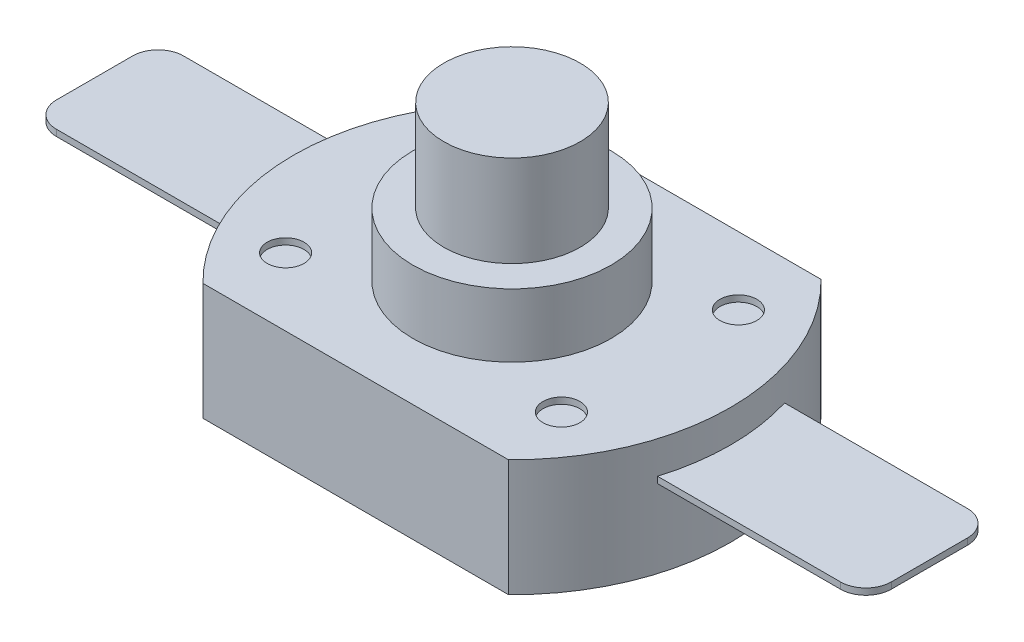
from build123d import *

# Parameters (mm, degrees)
EXTRUSION1_DEPTH        = 4.6
ESQUISSE2_R             = 3.9
EXTRUSION2_DEPTH        = 2.5
ESQUISSE3_R             = 2.683
EXTRUSION3_DEPTH        = 3.6
EXTRUSION4_DEPTH        = 0.25
ESQUISSE5_R             = 0.725763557
ENL_V_MAT_EXTRU_1_DEPTH = 0.25


with BuildPart() as part:
    # Esquisse1 → Extrusion1 (new body)
    with BuildSketch(Plane(origin=(0, 0, 0), x_dir=(1, 0, 0), z_dir=(0, 1, 0))):
        with BuildLine():
            Line((-6.011447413, -6.15), (6.011447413, -6.15))
            ThreePointArc((6.011447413, -6.15), (8.6, 0), (6.011447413, 6.15))
            Line((6.011447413, 6.15), (-6.011447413, 6.15))
            ThreePointArc((-6.011447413, 6.15), (-8.6, 0), (-6.011447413, -6.15))
        make_face()
    extrude(amount=EXTRUSION1_DEPTH)

    # Esquisse2 → Extrusion2 (add)
    with BuildSketch(Plane(origin=(0, 4.6, 0), x_dir=(-1, 0, 0), z_dir=(0, 1, 0))):
        with Locations(Location((0, 0, 0), (0, 0, 270))):
            Circle(ESQUISSE2_R)
    extrude(amount=EXTRUSION2_DEPTH)

    # Esquisse3 → Extrusion3 (add)
    with BuildSketch(Plane(origin=(0, 7.1, 0), x_dir=(-1, 0, 0), z_dir=(0, 1, 0))):
        with Locations(Location((0, 0, 0), (0, 0, 90))):
            Circle(ESQUISSE3_R)
    extrude(amount=EXTRUSION3_DEPTH)

    # Esquisse4 → Extrusion4 (add)
    with BuildSketch(Plane(origin=(0, 3.07, 0), x_dir=(-1, 0, 0), z_dir=(0, 1, 0))):
        with BuildLine():
            Line((8.228608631, 2.5), (15.428608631, 2.5))
            ThreePointArc((15.428608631, 2.5), (16.135715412, 2.207106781), (16.428608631, 1.5))
            Line((16.428608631, 1.5), (16.428608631, -1.5))
            ThreePointArc((16.428608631, -1.5), (16.135715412, -2.207106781), (15.428608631, -2.5))
            Line((15.428608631, -2.5), (8.228608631, -2.5))
            Line((8.228608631, -2.5), (8.228608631, 2.5))
        make_face()
        with BuildLine():
            Line((-16.428608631, 1.5), (-16.428608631, -1.5))
            ThreePointArc((-16.428608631, -1.5), (-16.135715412, -2.207106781), (-15.428608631, -2.5))
            Line((-15.428608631, -2.5), (-8.228608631, -2.5))
            Line((-8.228608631, -2.5), (-8.228608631, 2.5))
            Line((-8.228608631, 2.5), (-15.428608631, 2.5))
            ThreePointArc((-15.428608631, 2.5), (-16.135715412, 2.207106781), (-16.428608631, 1.5))
        make_face()
    extrude(amount=EXTRUSION4_DEPTH)

    # Esquisse5 → Enl_v. mat.-Extru.1 (cut)
    with BuildSketch(Plane(origin=(0, 4.6, 0), x_dir=(-1, 0, 0), z_dir=(0, 1, 0))):
        with Locations(Location((-5.427790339, 3.481978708, 0), (0, 0, 90))):
            Circle(ESQUISSE5_R)
        with Locations(Location((-5.427790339, -3.481978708, 0), (0, 0, 270))):
            Circle(ESQUISSE5_R)
        with Locations(Location((5.427790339, -3.481978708, 0), (0, 0, 90))):
            Circle(ESQUISSE5_R)
        with Locations(Location((5.427790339, 3.481978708, 0), (0, 0, 270))):
            Circle(ESQUISSE5_R)
    extrude(amount=-ENL_V_MAT_EXTRU_1_DEPTH, mode=Mode.SUBTRACT)


solid = part.part
